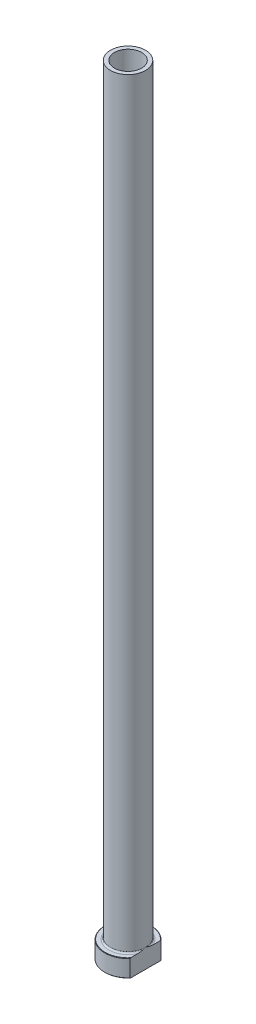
ISO-10303-21;
HEADER;
FILE_DESCRIPTION(('STEP AP214'),'2;1');
FILE_NAME('part.step','',(''),(''),'','','');
FILE_SCHEMA(('AUTOMOTIVE_DESIGN { 1 0 10303 214 1 1 1 1 }'));
ENDSEC;
DATA;
#1=APPLICATION_CONTEXT('core data for automotive mechanical design processes');
#2=APPLICATION_PROTOCOL_DEFINITION('international standard','automotive_design',2000,#1);
#3=PRODUCT_CONTEXT('',#1,'mechanical');
#4=PRODUCT('Part','Part','',(#3));
#5=PRODUCT_RELATED_PRODUCT_CATEGORY('part','',(#4));
#6=PRODUCT_DEFINITION_FORMATION('','',#4);
#7=PRODUCT_DEFINITION_CONTEXT('part definition',#1,'design');
#8=PRODUCT_DEFINITION('design','',#6,#7);
#9=PRODUCT_DEFINITION_SHAPE('','',#8);
#10=(LENGTH_UNIT() NAMED_UNIT(*) SI_UNIT(.MILLI.,.METRE.));
#11=(NAMED_UNIT(*) PLANE_ANGLE_UNIT() SI_UNIT($,.RADIAN.));
#12=(NAMED_UNIT(*) SI_UNIT($,.STERADIAN.) SOLID_ANGLE_UNIT());
#13=UNCERTAINTY_MEASURE_WITH_UNIT(LENGTH_MEASURE(1.E-05),#10,'distance_accuracy_value','');
#14=(GEOMETRIC_REPRESENTATION_CONTEXT(3) GLOBAL_UNCERTAINTY_ASSIGNED_CONTEXT((#13)) GLOBAL_UNIT_ASSIGNED_CONTEXT((#10,
#11,#12)) REPRESENTATION_CONTEXT('',''));
#15=CARTESIAN_POINT('',(0.,0.,0.));
#16=DIRECTION('',(0.,0.,1.));
#17=DIRECTION('',(1.,0.,0.));
#18=AXIS2_PLACEMENT_3D('',#15,#16,#17);
#19=CARTESIAN_POINT('',(0.,92.1876809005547,0.));
#20=DIRECTION('',(0.,1.,0.));
#21=DIRECTION('',(0.,0.,1.));
#22=AXIS2_PLACEMENT_3D('',#19,#20,#21);
#23=CYLINDRICAL_SURFACE('',#22,7.00000000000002);
#24=CARTESIAN_POINT('',(0.,400.,0.));
#25=DIRECTION('',(0.,1.,0.));
#26=DIRECTION('',(0.,0.,1.));
#27=AXIS2_PLACEMENT_3D('',#24,#25,#26);
#28=CIRCLE('',#27,7.00000000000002);
#29=CARTESIAN_POINT('',(0.,400.,7.00000000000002));
#30=VERTEX_POINT('',#29);
#31=EDGE_CURVE('E167',#30,#30,#28,.T.);
#32=ORIENTED_EDGE('',*,*,#31,.T.);
#33=EDGE_LOOP('',(#32));
#34=FACE_BOUND('',#33,.T.);
#35=CARTESIAN_POINT('',(0.,345.,0.));
#36=DIRECTION('',(0.,1.,0.));
#37=DIRECTION('',(0.,0.,1.));
#38=AXIS2_PLACEMENT_3D('',#35,#36,#37);
#39=CIRCLE('',#38,7.00000000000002);
#40=CARTESIAN_POINT('',(0.,345.,7.00000000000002));
#41=VERTEX_POINT('',#40);
#42=EDGE_CURVE('E170',#41,#41,#39,.T.);
#43=ORIENTED_EDGE('',*,*,#42,.F.);
#44=EDGE_LOOP('',(#43));
#45=FACE_BOUND('',#44,.T.);
#46=ADVANCED_FACE('F32',(#34,#45),#23,.F.);
#47=CARTESIAN_POINT('',(-7.00000000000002,400.,0.));
#48=DIRECTION('',(0.,1.,0.));
#49=DIRECTION('',(0.,0.,1.));
#50=AXIS2_PLACEMENT_3D('',#47,#48,#49);
#51=PLANE('',#50);
#52=CARTESIAN_POINT('',(0.,400.,0.));
#53=DIRECTION('',(0.,1.,0.));
#54=DIRECTION('',(0.,0.,1.));
#55=AXIS2_PLACEMENT_3D('',#52,#53,#54);
#56=CIRCLE('',#55,9.00000000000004);
#57=CARTESIAN_POINT('',(0.,400.,9.00000000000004));
#58=VERTEX_POINT('',#57);
#59=EDGE_CURVE('E174',#58,#58,#56,.T.);
#60=ORIENTED_EDGE('',*,*,#59,.T.);
#61=EDGE_LOOP('',(#60));
#62=FACE_BOUND('',#61,.T.);
#63=ORIENTED_EDGE('',*,*,#31,.F.);
#64=EDGE_LOOP('',(#63));
#65=FACE_BOUND('',#64,.T.);
#66=ADVANCED_FACE('F157',(#62,#65),#51,.T.);
#67=CARTESIAN_POINT('',(0.,92.1876809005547,0.));
#68=DIRECTION('',(0.,1.,0.));
#69=DIRECTION('',(0.,0.,1.));
#70=AXIS2_PLACEMENT_3D('',#67,#68,#69);
#71=CYLINDRICAL_SURFACE('',#70,9.00000000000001);
#72=CARTESIAN_POINT('',(0.,9.8,0.));
#73=DIRECTION('',(0.,1.,0.));
#74=DIRECTION('',(0.,0.,1.));
#75=AXIS2_PLACEMENT_3D('',#72,#73,#74);
#76=CIRCLE('',#75,9.00000000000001);
#77=CARTESIAN_POINT('',(9.00000000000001,9.8,0.));
#78=VERTEX_POINT('',#77);
#79=EDGE_CURVE('E180',#78,#78,#76,.T.);
#80=ORIENTED_EDGE('',*,*,#79,.T.);
#81=EDGE_LOOP('',(#80));
#82=FACE_BOUND('',#81,.T.);
#83=ORIENTED_EDGE('',*,*,#59,.F.);
#84=EDGE_LOOP('',(#83));
#85=FACE_BOUND('',#84,.T.);
#86=ADVANCED_FACE('F162',(#82,#85),#71,.T.);
#87=CARTESIAN_POINT('',(-8.99999999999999,9.,0.));
#88=DIRECTION('',(0.,1.,0.));
#89=DIRECTION('',(0.,0.,1.));
#90=AXIS2_PLACEMENT_3D('',#87,#88,#89);
#91=PLANE('',#90);
#92=DIRECTION('',(0.,0.,1.));
#93=VECTOR('',#92,1.);
#94=CARTESIAN_POINT('',(9.,9.,0.));
#95=LINE('',#94,#93);
#96=CARTESIAN_POINT('',(9.,9.,-7.63151361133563));
#97=VERTEX_POINT('',#96);
#98=CARTESIAN_POINT('',(9.,9.,-3.8781438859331));
#99=VERTEX_POINT('',#98);
#100=EDGE_CURVE('E54',#97,#99,#95,.T.);
#101=ORIENTED_EDGE('',*,*,#100,.F.);
#102=CARTESIAN_POINT('',(0.,9.,0.));
#103=DIRECTION('',(0.,1.,0.));
#104=DIRECTION('',(0.,0.,1.));
#105=AXIS2_PLACEMENT_3D('',#102,#103,#104);
#106=CIRCLE('',#105,11.8);
#107=CARTESIAN_POINT('',(8.99999999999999,9.,7.63151361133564));
#108=VERTEX_POINT('',#107);
#109=EDGE_CURVE('E186',#97,#108,#106,.T.);
#110=ORIENTED_EDGE('',*,*,#109,.T.);
#111=CARTESIAN_POINT('',(9.,9.,3.8781438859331));
#112=VERTEX_POINT('',#111);
#113=EDGE_CURVE('E134',#112,#108,#95,.T.);
#114=ORIENTED_EDGE('',*,*,#113,.F.);
#115=CARTESIAN_POINT('',(0.,9.,0.));
#116=DIRECTION('',(0.,1.,0.));
#117=DIRECTION('',(0.,0.,1.));
#118=AXIS2_PLACEMENT_3D('',#115,#116,#117);
#119=CIRCLE('',#118,9.80000000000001);
#120=EDGE_CURVE('E183',#112,#99,#119,.F.);
#121=ORIENTED_EDGE('',*,*,#120,.T.);
#122=EDGE_LOOP('',(#101,#110,#114,#121));
#123=FACE_BOUND('',#122,.T.);
#124=ADVANCED_FACE('F197',(#123),#91,.T.);
#125=CARTESIAN_POINT('',(0.,92.1876809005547,0.));
#126=DIRECTION('',(0.,1.,0.));
#127=DIRECTION('',(0.,0.,1.));
#128=AXIS2_PLACEMENT_3D('',#125,#126,#127);
#129=CYLINDRICAL_SURFACE('',#128,12.);
#130=DIRECTION('',(0.,-1.,0.));
#131=VECTOR('',#130,1.);
#132=CARTESIAN_POINT('',(8.99999999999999,400.,7.93725393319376));
#133=LINE('',#132,#131);
#134=CARTESIAN_POINT('',(8.99999999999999,8.80000000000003,7.93725393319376));
#135=VERTEX_POINT('',#134);
#136=CARTESIAN_POINT('',(8.99999999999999,0.199999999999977,7.93725393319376));
#137=VERTEX_POINT('',#136);
#138=EDGE_CURVE('E82',#135,#137,#133,.T.);
#139=ORIENTED_EDGE('',*,*,#138,.F.);
#140=CARTESIAN_POINT('',(0.,8.80000000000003,0.));
#141=DIRECTION('',(0.,1.,0.));
#142=DIRECTION('',(0.,0.,1.));
#143=AXIS2_PLACEMENT_3D('',#140,#141,#142);
#144=CIRCLE('',#143,12.);
#145=CARTESIAN_POINT('',(9.,8.80000000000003,-7.93725393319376));
#146=VERTEX_POINT('',#145);
#147=EDGE_CURVE('E95',#135,#146,#144,.F.);
#148=ORIENTED_EDGE('',*,*,#147,.T.);
#149=DIRECTION('',(0.,-1.,0.));
#150=VECTOR('',#149,1.);
#151=CARTESIAN_POINT('',(9.,400.,-7.93725393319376));
#152=LINE('',#151,#150);
#153=CARTESIAN_POINT('',(9.,0.199999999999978,-7.93725393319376));
#154=VERTEX_POINT('',#153);
#155=EDGE_CURVE('E192',#146,#154,#152,.T.);
#156=ORIENTED_EDGE('',*,*,#155,.T.);
#157=CARTESIAN_POINT('',(0.,0.199999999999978,0.));
#158=DIRECTION('',(0.,-1.,0.));
#159=DIRECTION('',(0.,0.,-1.));
#160=AXIS2_PLACEMENT_3D('',#157,#158,#159);
#161=CIRCLE('',#160,12.);
#162=EDGE_CURVE('E98',#154,#137,#161,.F.);
#163=ORIENTED_EDGE('',*,*,#162,.T.);
#164=EDGE_LOOP('',(#139,#148,#156,#163));
#165=FACE_BOUND('',#164,.T.);
#166=ADVANCED_FACE('F190',(#165),#129,.T.);
#167=CARTESIAN_POINT('',(-12.,0.,0.));
#168=DIRECTION('',(0.,-1.,0.));
#169=DIRECTION('',(0.,0.,-1.));
#170=AXIS2_PLACEMENT_3D('',#167,#168,#169);
#171=PLANE('',#170);
#172=CARTESIAN_POINT('',(0.,0.,0.));
#173=DIRECTION('',(0.,-1.,0.));
#174=DIRECTION('',(0.,0.,-1.));
#175=AXIS2_PLACEMENT_3D('',#172,#173,#174);
#176=CIRCLE('',#175,7.74999999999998);
#177=CARTESIAN_POINT('',(0.,0.,-7.74999999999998));
#178=VERTEX_POINT('',#177);
#179=EDGE_CURVE('E40',#178,#178,#176,.F.);
#180=ORIENTED_EDGE('',*,*,#179,.T.);
#181=EDGE_LOOP('',(#180));
#182=FACE_BOUND('',#181,.T.);
#183=DIRECTION('',(0.,0.,-1.));
#184=VECTOR('',#183,1.);
#185=CARTESIAN_POINT('',(8.99999999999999,0.,7.93725393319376));
#186=LINE('',#185,#184);
#187=CARTESIAN_POINT('',(8.99999999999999,0.,7.63151361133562));
#188=VERTEX_POINT('',#187);
#189=CARTESIAN_POINT('',(9.,0.,-7.63151361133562));
#190=VERTEX_POINT('',#189);
#191=EDGE_CURVE('E47',#188,#190,#186,.T.);
#192=ORIENTED_EDGE('',*,*,#191,.F.);
#193=CARTESIAN_POINT('',(0.,0.,0.));
#194=DIRECTION('',(0.,-1.,0.));
#195=DIRECTION('',(0.,0.,-1.));
#196=AXIS2_PLACEMENT_3D('',#193,#194,#195);
#197=CIRCLE('',#196,11.8);
#198=EDGE_CURVE('E92',#188,#190,#197,.T.);
#199=ORIENTED_EDGE('',*,*,#198,.T.);
#200=EDGE_LOOP('',(#192,#199));
#201=FACE_BOUND('',#200,.T.);
#202=ADVANCED_FACE('F91',(#182,#201),#171,.T.);
#203=CARTESIAN_POINT('',(0.,92.1876809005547,0.));
#204=DIRECTION('',(0.,1.,0.));
#205=DIRECTION('',(0.,0.,1.));
#206=AXIS2_PLACEMENT_3D('',#203,#204,#205);
#207=CYLINDRICAL_SURFACE('',#206,7.25000000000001);
#208=CARTESIAN_POINT('',(0.,0.5,0.));
#209=DIRECTION('',(0.,-1.,0.));
#210=DIRECTION('',(0.,0.,-1.));
#211=AXIS2_PLACEMENT_3D('',#208,#209,#210);
#212=CIRCLE('',#211,7.25000000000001);
#213=CARTESIAN_POINT('',(0.,0.5,-7.25000000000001));
#214=VERTEX_POINT('',#213);
#215=EDGE_CURVE('E11',#214,#214,#212,.T.);
#216=ORIENTED_EDGE('',*,*,#215,.T.);
#217=EDGE_LOOP('',(#216));
#218=FACE_BOUND('',#217,.T.);
#219=CARTESIAN_POINT('',(0.,333.,0.));
#220=DIRECTION('',(0.,1.,0.));
#221=DIRECTION('',(0.,0.,1.));
#222=AXIS2_PLACEMENT_3D('',#219,#220,#221);
#223=CIRCLE('',#222,7.25000000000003);
#224=CARTESIAN_POINT('',(0.,333.,7.25000000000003));
#225=VERTEX_POINT('',#224);
#226=EDGE_CURVE('E172',#225,#225,#223,.T.);
#227=ORIENTED_EDGE('',*,*,#226,.T.);
#228=EDGE_LOOP('',(#227));
#229=FACE_BOUND('',#228,.T.);
#230=ADVANCED_FACE('F215',(#218,#229),#207,.F.);
#231=CARTESIAN_POINT('',(0.,333.,0.));
#232=DIRECTION('',(0.,-1.,0.));
#233=DIRECTION('',(0.,0.,-1.));
#234=AXIS2_PLACEMENT_3D('',#231,#232,#233);
#235=CONICAL_SURFACE('',#234,7.25000000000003,0.0208303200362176);
#236=ORIENTED_EDGE('',*,*,#42,.T.);
#237=EDGE_LOOP('',(#236));
#238=FACE_BOUND('',#237,.T.);
#239=ORIENTED_EDGE('',*,*,#226,.F.);
#240=EDGE_LOOP('',(#239));
#241=FACE_BOUND('',#240,.T.);
#242=ADVANCED_FACE('F111',(#238,#241),#235,.F.);
#243=CARTESIAN_POINT('',(0.,9.8,0.));
#244=DIRECTION('',(0.,1.,0.));
#245=DIRECTION('',(0.,0.,1.));
#246=AXIS2_PLACEMENT_3D('',#243,#244,#245);
#247=TOROIDAL_SURFACE('',#246,9.80000000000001,0.8);
#248=ORIENTED_EDGE('',*,*,#120,.F.);
#249=CARTESIAN_POINT('',(9.00000000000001,9.8,0.));
#250=CARTESIAN_POINT('',(9.00000000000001,9.8000010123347,-6.46463501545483E-11));
#251=CARTESIAN_POINT('',(9.00000000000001,9.80000202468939,3.17332804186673E-07));
#252=CARTESIAN_POINT('',(9.00000000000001,9.80000393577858,1.2415479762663E-06));
#253=CARTESIAN_POINT('',(9.00000000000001,9.80000482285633,1.86583118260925E-06));
#254=CARTESIAN_POINT('',(9.00000000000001,9.80000663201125,3.35641421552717E-06));
#255=CARTESIAN_POINT('',(9.00000000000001,9.80000753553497,4.24567513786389E-06));
#256=CARTESIAN_POINT('',(9.00000000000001,9.80000918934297,6.11612340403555E-06));
#257=CARTESIAN_POINT('',(9.00000000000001,9.80000994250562,7.09492169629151E-06));
#258=CARTESIAN_POINT('',(9.00000000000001,9.80001263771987,1.07802727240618E-05));
#259=CARTESIAN_POINT('',(9.00000000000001,9.80001442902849,1.3600862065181E-05));
#260=CARTESIAN_POINT('',(9.00000000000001,9.80001746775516,1.92722568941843E-05));
#261=CARTESIAN_POINT('',(9.00000000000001,9.80001874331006,2.21087252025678E-05));
#262=CARTESIAN_POINT('',(9.00000000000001,9.8000239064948,3.37975092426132E-05));
#263=CARTESIAN_POINT('',(9.,9.80002763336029,4.27293238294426E-05));
#264=CARTESIAN_POINT('',(9.,9.80003330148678,5.98324887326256E-05));
#265=CARTESIAN_POINT('',(9.,9.80003541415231,6.79473032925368E-05));
#266=CARTESIAN_POINT('',(9.,9.80005049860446,0.000127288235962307));
#267=CARTESIAN_POINT('',(9.,9.80006163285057,0.000178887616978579));
#268=CARTESIAN_POINT('',(8.99999999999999,9.80011034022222,0.000381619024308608));
#269=CARTESIAN_POINT('',(8.99999999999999,9.80015710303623,0.000530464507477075));
#270=CARTESIAN_POINT('',(9.00000000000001,9.80033804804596,0.00111728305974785));
#271=CARTESIAN_POINT('',(9.,9.80046603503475,0.00155660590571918));
#272=CARTESIAN_POINT('',(8.99999999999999,9.80097635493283,0.00329406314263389));
#273=CARTESIAN_POINT('',(8.99999999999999,9.80136631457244,0.00459050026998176));
#274=CARTESIAN_POINT('',(9.00000000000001,9.80298403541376,0.00998416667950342));
#275=CARTESIAN_POINT('',(9.,9.80420236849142,0.0140834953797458));
#276=CARTESIAN_POINT('',(8.99999999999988,9.82648661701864,0.0890427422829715));
#277=CARTESIAN_POINT('',(8.99999999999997,9.84764626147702,0.159882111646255));
#278=CARTESIAN_POINT('',(9.00000000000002,9.88895908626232,0.298764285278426));
#279=CARTESIAN_POINT('',(9.00000000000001,9.90911860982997,0.366805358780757));
#280=CARTESIAN_POINT('',(8.99999999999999,9.95179311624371,0.5115245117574));
#281=CARTESIAN_POINT('',(8.99999999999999,9.97428452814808,0.588209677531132));
#282=CARTESIAN_POINT('',(9.,10.0191408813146,0.742532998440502));
#283=CARTESIAN_POINT('',(9.,10.0415017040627,0.820172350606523));
#284=CARTESIAN_POINT('',(9.,10.079411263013,0.953448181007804));
#285=CARTESIAN_POINT('',(9.,10.0950851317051,1.009049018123));
#286=CARTESIAN_POINT('',(9.,10.1260784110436,1.1201953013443));
#287=CARTESIAN_POINT('',(9.,10.1413986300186,1.17574052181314));
#288=CARTESIAN_POINT('',(9.,10.1860703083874,1.33980716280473));
#289=CARTESIAN_POINT('',(9.,10.2149083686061,1.44846861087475));
#290=CARTESIAN_POINT('',(9.,10.2856369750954,1.72417832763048));
#291=CARTESIAN_POINT('',(9.,10.3263124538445,1.89154391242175));
#292=CARTESIAN_POINT('',(9.,10.4020454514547,2.22904779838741));
#293=CARTESIAN_POINT('',(9.,10.4370523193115,2.39919757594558));
#294=CARTESIAN_POINT('',(9.,10.5014391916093,2.75494052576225));
#295=CARTESIAN_POINT('',(9.,10.5301301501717,2.94066439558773));
#296=CARTESIAN_POINT('',(9.,10.5633122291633,3.2201620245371));
#297=CARTESIAN_POINT('',(9.,10.5727244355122,3.31335338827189));
#298=CARTESIAN_POINT('',(9.,10.5877042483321,3.50003892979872));
#299=CARTESIAN_POINT('',(9.,10.5932725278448,3.59353305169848));
#300=CARTESIAN_POINT('',(9.,10.5997812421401,3.77831079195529));
#301=CARTESIAN_POINT('',(9.,10.6008358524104,3.86959010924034));
#302=CARTESIAN_POINT('',(9.,10.5977997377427,4.05215299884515));
#303=CARTESIAN_POINT('',(8.99999999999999,10.5937049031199,4.14343651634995));
#304=CARTESIAN_POINT('',(8.99999999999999,10.579384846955,4.32415905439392));
#305=CARTESIAN_POINT('',(8.99999999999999,10.5692536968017,4.41360502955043));
#306=CARTESIAN_POINT('',(8.99999999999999,10.5415393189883,4.5912576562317));
#307=CARTESIAN_POINT('',(8.99999999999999,10.5239649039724,4.67946564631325));
#308=CARTESIAN_POINT('',(8.99999999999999,10.4790565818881,4.85471882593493));
#309=CARTESIAN_POINT('',(8.99999999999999,10.4516029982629,4.94173554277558));
#310=CARTESIAN_POINT('',(8.99999999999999,10.4007972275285,5.06830195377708));
#311=CARTESIAN_POINT('',(8.99999999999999,10.3822808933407,5.10979172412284));
#312=CARTESIAN_POINT('',(8.99999999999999,10.3414775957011,5.19085457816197));
#313=CARTESIAN_POINT('',(8.99999999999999,10.3191952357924,5.23042992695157));
#314=CARTESIAN_POINT('',(8.99999999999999,10.2750362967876,5.29920261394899));
#315=CARTESIAN_POINT('',(8.99999999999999,10.2539514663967,5.32890420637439));
#316=CARTESIAN_POINT('',(8.99999999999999,10.2085010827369,5.3857714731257));
#317=CARTESIAN_POINT('',(8.99999999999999,10.18413270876,5.4129349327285));
#318=CARTESIAN_POINT('',(8.99999999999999,10.1314615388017,5.46389233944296));
#319=CARTESIAN_POINT('',(8.99999999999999,10.1031152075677,5.4876421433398));
#320=CARTESIAN_POINT('',(8.99999999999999,10.0426124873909,5.52966859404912));
#321=CARTESIAN_POINT('',(8.99999999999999,10.0104678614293,5.54796155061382));
#322=CARTESIAN_POINT('',(8.99999999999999,9.95377518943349,5.57238639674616));
#323=CARTESIAN_POINT('',(8.99999999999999,9.93009823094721,5.58053697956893));
#324=CARTESIAN_POINT('',(8.99999999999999,9.88171464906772,5.59278453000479));
#325=CARTESIAN_POINT('',(8.99999999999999,9.8570089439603,5.5968850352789));
#326=CARTESIAN_POINT('',(8.99999999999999,9.80717489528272,5.60067699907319));
#327=CARTESIAN_POINT('',(8.99999999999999,9.7820454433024,5.60035415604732));
#328=CARTESIAN_POINT('',(8.99999999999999,9.73223420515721,5.5952956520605));
#329=CARTESIAN_POINT('',(8.99999999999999,9.70755259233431,5.59055831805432));
#330=CARTESIAN_POINT('',(8.99999999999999,9.66020362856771,5.57733425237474));
#331=CARTESIAN_POINT('',(8.99999999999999,9.63749568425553,5.56898983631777));
#332=CARTESIAN_POINT('',(8.99999999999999,9.59351516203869,5.54915687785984));
#333=CARTESIAN_POINT('',(8.99999999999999,9.57224307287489,5.53766727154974));
#334=CARTESIAN_POINT('',(8.99999999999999,9.51928150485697,5.50462580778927));
#335=CARTESIAN_POINT('',(8.99999999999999,9.48880776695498,5.48112661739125));
#336=CARTESIAN_POINT('',(8.99999999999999,9.4318905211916,5.42965338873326));
#337=CARTESIAN_POINT('',(8.99999999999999,9.40546009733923,5.40166539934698));
#338=CARTESIAN_POINT('',(8.99999999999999,9.34005551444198,5.32319042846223));
#339=CARTESIAN_POINT('',(8.99999999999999,9.30430472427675,5.2700386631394));
#340=CARTESIAN_POINT('',(8.99999999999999,9.24095813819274,5.15926391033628));
#341=CARTESIAN_POINT('',(8.99999999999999,9.21336826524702,5.10163771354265));
#342=CARTESIAN_POINT('',(8.99999999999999,9.16551403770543,4.98579619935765));
#343=CARTESIAN_POINT('',(8.99999999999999,9.14502939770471,4.92767012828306));
#344=CARTESIAN_POINT('',(8.99999999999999,9.10900516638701,4.80987690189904));
#345=CARTESIAN_POINT('',(8.99999999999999,9.0934705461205,4.75020826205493));
#346=CARTESIAN_POINT('',(8.99999999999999,9.06639912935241,4.62926355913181));
#347=CARTESIAN_POINT('',(8.99999999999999,9.05491059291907,4.56797688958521));
#348=CARTESIAN_POINT('',(8.99999999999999,9.03554988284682,4.44488746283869));
#349=CARTESIAN_POINT('',(8.99999999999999,9.02767548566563,4.38308504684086));
#350=CARTESIAN_POINT('',(8.99999999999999,9.01237706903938,4.23320098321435));
#351=CARTESIAN_POINT('',(8.99999999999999,9.00652460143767,4.14495990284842));
#352=CARTESIAN_POINT('',(8.99999999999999,8.99996624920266,3.96827125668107));
#353=CARTESIAN_POINT('',(9.,8.99926276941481,3.8798236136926));
#354=CARTESIAN_POINT('',(9.,9.00218728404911,3.70272096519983));
#355=CARTESIAN_POINT('',(9.,9.00582939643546,3.6140662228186));
#356=CARTESIAN_POINT('',(9.,9.01681466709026,3.4369808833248));
#357=CARTESIAN_POINT('',(9.,9.02415848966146,3.34855032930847));
#358=CARTESIAN_POINT('',(9.,9.04989749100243,3.09391807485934));
#359=CARTESIAN_POINT('',(9.,9.07232194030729,2.92812217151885));
#360=CARTESIAN_POINT('',(9.,9.12539895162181,2.59921508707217));
#361=CARTESIAN_POINT('',(9.,9.15598725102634,2.43609307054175));
#362=CARTESIAN_POINT('',(9.,9.22330285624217,2.11182788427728));
#363=CARTESIAN_POINT('',(9.,9.26000471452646,1.95067936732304));
#364=CARTESIAN_POINT('',(9.,9.31897632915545,1.70786584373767));
#365=CARTESIAN_POINT('',(9.,9.33955107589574,1.62578051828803));
#366=CARTESIAN_POINT('',(9.,9.38177259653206,1.46165638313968));
#367=CARTESIAN_POINT('',(9.,9.40342203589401,1.37961825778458));
#368=CARTESIAN_POINT('',(9.,9.45602430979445,1.18435079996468));
#369=CARTESIAN_POINT('',(9.,9.48736095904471,1.07122519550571));
#370=CARTESIAN_POINT('',(9.,9.5508395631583,0.846545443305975));
#371=CARTESIAN_POINT('',(8.99999999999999,9.58296886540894,0.734987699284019));
#372=CARTESIAN_POINT('',(9.,9.64431039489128,0.524609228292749));
#373=CARTESIAN_POINT('',(9.,9.67344475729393,0.425765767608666));
#374=CARTESIAN_POINT('',(8.99999999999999,9.71808680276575,0.275077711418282));
#375=CARTESIAN_POINT('',(8.99999999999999,9.73349584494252,0.223203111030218));
#376=CARTESIAN_POINT('',(9.00000000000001,9.76415269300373,0.120285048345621));
#377=CARTESIAN_POINT('',(9.00000000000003,9.77939925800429,0.069241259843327));
#378=CARTESIAN_POINT('',(8.99999999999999,9.79579831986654,0.0140813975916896));
#379=CARTESIAN_POINT('',(8.99999999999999,9.79701722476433,0.00997994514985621));
#380=CARTESIAN_POINT('',(9.,9.7986350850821,0.00458578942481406));
#381=CARTESIAN_POINT('',(9.,9.79902455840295,0.00329097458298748));
#382=CARTESIAN_POINT('',(8.99999999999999,9.79953428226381,0.00155554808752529));
#383=CARTESIAN_POINT('',(8.99999999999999,9.79966215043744,0.00111663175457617));
#384=CARTESIAN_POINT('',(9.,9.7998429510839,0.000530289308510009));
#385=CARTESIAN_POINT('',(9.,9.7998896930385,0.000381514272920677));
#386=CARTESIAN_POINT('',(8.99999999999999,9.79993838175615,0.000178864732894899));
#387=CARTESIAN_POINT('',(8.99999999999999,9.79994951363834,0.000127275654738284));
#388=CARTESIAN_POINT('',(9.,9.79996459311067,6.79451409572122E-05));
#389=CARTESIAN_POINT('',(9.00000000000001,9.799966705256,5.98309375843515E-05));
#390=CARTESIAN_POINT('',(9.00000000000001,9.79997237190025,4.27289898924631E-05));
#391=CARTESIAN_POINT('',(9.00000000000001,9.79997609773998,3.37977495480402E-05));
#392=CARTESIAN_POINT('',(9.00000000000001,9.79998125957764,2.21095479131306E-05));
#393=CARTESIAN_POINT('',(9.00000000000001,9.79998253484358,1.92731252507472E-05));
#394=CARTESIAN_POINT('',(9.00000000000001,9.79998557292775,1.36017707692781E-05));
#395=CARTESIAN_POINT('',(9.00000000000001,9.79998736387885,1.07811711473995E-05));
#396=CARTESIAN_POINT('',(9.00000000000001,9.79999005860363,7.09574593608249E-06));
#397=CARTESIAN_POINT('',(9.00000000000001,9.79999081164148,6.11691275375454E-06));
#398=CARTESIAN_POINT('',(9.00000000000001,9.79999246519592,4.24637220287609E-06));
#399=CARTESIAN_POINT('',(9.00000000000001,9.79999336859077,3.35705330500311E-06));
#400=CARTESIAN_POINT('',(9.00000000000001,9.79999517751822,1.86633240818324E-06));
#401=CARTESIAN_POINT('',(9.00000000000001,9.79999606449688,1.24197376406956E-06));
#402=CARTESIAN_POINT('',(9.00000000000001,9.79999797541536,3.1757107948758E-07));
#403=CARTESIAN_POINT('',(9.00000000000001,9.79999898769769,6.46482157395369E-11));
#404=CARTESIAN_POINT('',(9.00000000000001,9.8,0.));
#405=B_SPLINE_CURVE_WITH_KNOTS('',3,(#249,#250,#251,#252,#253,#254,#255,#256,#257,#258,#259,
#260,#261,#262,#263,#264,#265,#266,#267,#268,#269,#270,#271,#272,#273,#274,#275,#276,#277,#278,
#279,#280,#281,#282,#283,#284,#285,#286,#287,#288,#289,#290,#291,#292,#293,#294,#295,#296,#297,
#298,#299,#300,#301,#302,#303,#304,#305,#306,#307,#308,#309,#310,#311,#312,#313,#314,#315,#316,
#317,#318,#319,#320,#321,#322,#323,#324,#325,#326,#327,#328,#329,#330,#331,#332,#333,#334,#335,
#336,#337,#338,#339,#340,#341,#342,#343,#344,#345,#346,#347,#348,#349,#350,#351,#352,#353,#354,
#355,#356,#357,#358,#359,#360,#361,#362,#363,#364,#365,#366,#367,#368,#369,#370,#371,#372,#373,
#374,#375,#376,#377,#378,#379,#380,#381,#382,#383,#384,#385,#386,#387,#388,#389,#390,#391,#392,
#393,#394,#395,#396,#397,#398,#399,#400,#401,#402,#403,#404),.UNSPECIFIED.,.T.,.F.,(4,2,2,2,2,2,
2,2,2,2,2,2,2,2,2,2,2,2,2,2,2,2,2,2,2,2,2,2,2,2,2,2,2,2,2,2,2,2,2,2,2,2,2,2,2,2,2,2,2,2,2,2,2,2,
2,2,2,2,2,2,2,2,2,2,2,2,2,2,2,2,2,2,2,2,2,2,2,4),(0.,3.0477132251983E-06,6.29345622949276E-06,
1.00769788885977E-05,1.37791101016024E-05,2.37619242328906E-05,3.30844746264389E-05,
6.20551883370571E-05,8.71784949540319E-05,0.000245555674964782,0.000713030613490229,
0.00208637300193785,0.00614710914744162,0.0189775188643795,0.240764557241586,0.453660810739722,
0.693405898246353,0.935790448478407,1.10909318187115,1.28194996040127,1.61921055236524,
2.1358388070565,2.65685508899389,3.22023907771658,3.50117319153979,3.78205810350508,
4.05579427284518,4.32974904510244,4.59954218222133,4.86901677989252,5.1418722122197,
5.27802968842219,5.41402191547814,5.52311134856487,5.63229509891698,5.74278355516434,
5.85293838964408,5.92775570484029,6.00250761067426,6.07750126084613,6.15252334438,
6.22482267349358,6.29714648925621,6.41192958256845,6.52707659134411,6.71816463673,
6.90939103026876,7.09400621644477,7.27880622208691,7.46574121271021,7.65256103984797,
7.91766914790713,8.18290106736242,8.44899702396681,8.71514075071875,9.21672782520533,
9.71447745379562,10.210204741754,10.464073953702,10.7186077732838,11.0707555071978,
11.4190290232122,11.7281703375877,11.8905163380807,12.050326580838,12.0631635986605,
12.0672192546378,12.0685913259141,12.0690585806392,12.0692169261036,12.0692420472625,
12.0692710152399,12.0692803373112,12.0692903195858,12.069294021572,12.0692978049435,
12.0693010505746,12.0693040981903),.UNSPECIFIED.);
#406=EDGE_CURVE('E126',#112,#78,#405,.T.);
#407=ORIENTED_EDGE('',*,*,#406,.T.);
#408=ORIENTED_EDGE('',*,*,#79,.F.);
#409=CARTESIAN_POINT('',(9.00000000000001,9.8,0.));
#410=CARTESIAN_POINT('',(9.00000000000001,9.7999989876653,6.46502918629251E-11));
#411=CARTESIAN_POINT('',(9.00000000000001,9.79999797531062,-3.17332800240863E-07));
#412=CARTESIAN_POINT('',(9.00000000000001,9.79999606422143,-1.24154797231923E-06));
#413=CARTESIAN_POINT('',(9.00000000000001,9.79999517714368,-1.86583117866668E-06));
#414=CARTESIAN_POINT('',(9.00000000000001,9.79999336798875,-3.35641421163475E-06));
#415=CARTESIAN_POINT('',(9.00000000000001,9.79999246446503,-4.24567513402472E-06));
#416=CARTESIAN_POINT('',(9.00000000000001,9.79999081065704,-6.11612340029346E-06));
#417=CARTESIAN_POINT('',(9.00000000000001,9.79999005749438,-7.09492169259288E-06));
#418=CARTESIAN_POINT('',(9.00000000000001,9.79998736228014,-1.07802727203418E-05));
#419=CARTESIAN_POINT('',(9.00000000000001,9.79998557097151,-1.36008620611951E-05));
#420=CARTESIAN_POINT('',(9.00000000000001,9.79998253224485,-1.92722568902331E-05));
#421=CARTESIAN_POINT('',(9.00000000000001,9.79998125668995,-2.21087251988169E-05));
#422=CARTESIAN_POINT('',(9.00000000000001,9.79997609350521,-3.37975092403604E-05));
#423=CARTESIAN_POINT('',(9.00000000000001,9.79997236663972,-4.27293238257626E-05));
#424=CARTESIAN_POINT('',(9.00000000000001,9.79996669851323,-5.9832488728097E-05));
#425=CARTESIAN_POINT('',(9.,9.7999645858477,-6.79473032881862E-05));
#426=CARTESIAN_POINT('',(8.99999999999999,9.79994950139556,-0.000127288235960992));
#427=CARTESIAN_POINT('',(8.99999999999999,9.79993836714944,-0.000178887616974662));
#428=CARTESIAN_POINT('',(9.,9.79988965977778,-0.000381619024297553));
#429=CARTESIAN_POINT('',(9.,9.79984289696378,-0.000530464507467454));
#430=CARTESIAN_POINT('',(8.99999999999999,9.79966195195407,-0.00111728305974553));
#431=CARTESIAN_POINT('',(8.99999999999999,9.79953396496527,-0.0015566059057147));
#432=CARTESIAN_POINT('',(9.,9.79902364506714,-0.00329406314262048));
#433=CARTESIAN_POINT('',(9.,9.79863368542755,-0.00459050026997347));
#434=CARTESIAN_POINT('',(8.99999999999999,9.79701596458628,-0.00998416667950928));
#435=CARTESIAN_POINT('',(8.99999999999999,9.7957976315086,-0.0140834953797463));
#436=CARTESIAN_POINT('',(9.00000000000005,9.7735133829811,-0.0890427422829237));
#437=CARTESIAN_POINT('',(9.00000000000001,9.7523537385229,-0.159882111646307));
#438=CARTESIAN_POINT('',(8.99999999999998,9.71104091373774,-0.298764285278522));
#439=CARTESIAN_POINT('',(8.99999999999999,9.69088139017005,-0.366805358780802));
#440=CARTESIAN_POINT('',(9.,9.64820688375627,-0.511524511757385));
#441=CARTESIAN_POINT('',(9.,9.62571547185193,-0.588209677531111));
#442=CARTESIAN_POINT('',(8.99999999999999,9.58085911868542,-0.742532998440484));
#443=CARTESIAN_POINT('',(9.,9.55849829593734,-0.820172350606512));
#444=CARTESIAN_POINT('',(9.,9.52058873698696,-0.953448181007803));
#445=CARTESIAN_POINT('',(9.,9.50491486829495,-1.00904901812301));
#446=CARTESIAN_POINT('',(9.,9.47392158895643,-1.1201953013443));
#447=CARTESIAN_POINT('',(9.,9.45860136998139,-1.17574052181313));
#448=CARTESIAN_POINT('',(9.,9.41392969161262,-1.33980716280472));
#449=CARTESIAN_POINT('',(9.,9.38509163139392,-1.44846861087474));
#450=CARTESIAN_POINT('',(9.,9.31436302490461,-1.72417832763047));
#451=CARTESIAN_POINT('',(9.,9.27368754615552,-1.89154391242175));
#452=CARTESIAN_POINT('',(9.,9.19795454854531,-2.22904779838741));
#453=CARTESIAN_POINT('',(9.,9.16294768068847,-2.39919757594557));
#454=CARTESIAN_POINT('',(9.,9.09856080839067,-2.75494052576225));
#455=CARTESIAN_POINT('',(9.,9.06986984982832,-2.94066439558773));
#456=CARTESIAN_POINT('',(9.,9.03668777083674,-3.22016202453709));
#457=CARTESIAN_POINT('',(9.,9.0272755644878,-3.31335338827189));
#458=CARTESIAN_POINT('',(9.,9.01229575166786,-3.50003892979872));
#459=CARTESIAN_POINT('',(9.,9.00672747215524,-3.59353305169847));
#460=CARTESIAN_POINT('',(9.,9.00021875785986,-3.77831079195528));
#461=CARTESIAN_POINT('',(9.,8.99916414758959,-3.86959010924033));
#462=CARTESIAN_POINT('',(9.,9.00220026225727,-4.05215299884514));
#463=CARTESIAN_POINT('',(9.,9.0062950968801,-4.14343651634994));
#464=CARTESIAN_POINT('',(9.,9.02061515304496,-4.32415905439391));
#465=CARTESIAN_POINT('',(9.,9.03074630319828,-4.41360502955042));
#466=CARTESIAN_POINT('',(9.,9.0584606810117,-4.59125765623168));
#467=CARTESIAN_POINT('',(9.,9.07603509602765,-4.67946564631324));
#468=CARTESIAN_POINT('',(9.,9.12094341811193,-4.85471882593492));
#469=CARTESIAN_POINT('',(9.,9.14839700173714,-4.94173554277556));
#470=CARTESIAN_POINT('',(9.,9.19920277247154,-5.06830195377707));
#471=CARTESIAN_POINT('',(9.,9.21771910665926,-5.10979172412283));
#472=CARTESIAN_POINT('',(9.,9.25852240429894,-5.19085457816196));
#473=CARTESIAN_POINT('',(9.,9.28080476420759,-5.23042992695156));
#474=CARTESIAN_POINT('',(9.,9.32496370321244,-5.29920261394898));
#475=CARTESIAN_POINT('',(9.,9.34604853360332,-5.32890420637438));
#476=CARTESIAN_POINT('',(9.,9.39149891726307,-5.38577147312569));
#477=CARTESIAN_POINT('',(9.,9.41586729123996,-5.41293493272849));
#478=CARTESIAN_POINT('',(9.,9.46853846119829,-5.46389233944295));
#479=CARTESIAN_POINT('',(9.,9.49688479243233,-5.48764214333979));
#480=CARTESIAN_POINT('',(9.,9.55738751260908,-5.52966859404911));
#481=CARTESIAN_POINT('',(9.,9.58953213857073,-5.54796155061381));
#482=CARTESIAN_POINT('',(9.,9.64622481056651,-5.57238639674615));
#483=CARTESIAN_POINT('',(9.,9.66990176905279,-5.58053697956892));
#484=CARTESIAN_POINT('',(9.,9.71828535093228,-5.59278453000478));
#485=CARTESIAN_POINT('',(9.,9.7429910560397,-5.59688503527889));
#486=CARTESIAN_POINT('',(9.,9.79282510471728,-5.60067699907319));
#487=CARTESIAN_POINT('',(9.,9.81795455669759,-5.60035415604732));
#488=CARTESIAN_POINT('',(9.,9.86776579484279,-5.5952956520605));
#489=CARTESIAN_POINT('',(9.,9.89244740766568,-5.59055831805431));
#490=CARTESIAN_POINT('',(9.,9.93979637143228,-5.57733425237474));
#491=CARTESIAN_POINT('',(9.,9.96250431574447,-5.56898983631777));
#492=CARTESIAN_POINT('',(9.,10.0064848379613,-5.54915687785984));
#493=CARTESIAN_POINT('',(9.,10.0277569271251,-5.53766727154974));
#494=CARTESIAN_POINT('',(9.,10.080718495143,-5.50462580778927));
#495=CARTESIAN_POINT('',(9.,10.111192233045,-5.48112661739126));
#496=CARTESIAN_POINT('',(9.,10.1681094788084,-5.42965338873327));
#497=CARTESIAN_POINT('',(9.,10.1945399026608,-5.40166539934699));
#498=CARTESIAN_POINT('',(9.,10.259944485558,-5.32319042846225));
#499=CARTESIAN_POINT('',(9.,10.2956952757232,-5.27003866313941));
#500=CARTESIAN_POINT('',(9.,10.3590418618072,-5.1592639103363));
#501=CARTESIAN_POINT('',(9.,10.386631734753,-5.10163771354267));
#502=CARTESIAN_POINT('',(9.,10.4344859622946,-4.98579619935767));
#503=CARTESIAN_POINT('',(9.,10.4549706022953,-4.92767012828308));
#504=CARTESIAN_POINT('',(9.,10.490994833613,-4.80987690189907));
#505=CARTESIAN_POINT('',(9.,10.5065294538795,-4.75020826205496));
#506=CARTESIAN_POINT('',(9.,10.5336008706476,-4.62926355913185));
#507=CARTESIAN_POINT('',(9.,10.5450894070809,-4.56797688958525));
#508=CARTESIAN_POINT('',(9.,10.5644501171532,-4.44488746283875));
#509=CARTESIAN_POINT('',(9.,10.5723245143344,-4.38308504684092));
#510=CARTESIAN_POINT('',(9.,10.5876229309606,-4.23320098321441));
#511=CARTESIAN_POINT('',(9.,10.5934753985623,-4.14495990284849));
#512=CARTESIAN_POINT('',(9.,10.6000337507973,-3.96827125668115));
#513=CARTESIAN_POINT('',(9.,10.6007372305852,-3.87982361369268));
#514=CARTESIAN_POINT('',(9.,10.5978127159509,-3.70272096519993));
#515=CARTESIAN_POINT('',(9.,10.5941706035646,-3.61406622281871));
#516=CARTESIAN_POINT('',(9.,10.5831853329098,-3.43698088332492));
#517=CARTESIAN_POINT('',(9.,10.5758415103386,-3.3485503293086));
#518=CARTESIAN_POINT('',(9.,10.5501025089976,-3.09391807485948));
#519=CARTESIAN_POINT('',(9.,10.5276780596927,-2.92812217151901));
#520=CARTESIAN_POINT('',(9.,10.4746010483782,-2.59921508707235));
#521=CARTESIAN_POINT('',(9.,10.4440127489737,-2.43609307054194));
#522=CARTESIAN_POINT('',(9.,10.3766971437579,-2.11182788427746));
#523=CARTESIAN_POINT('',(9.,10.3399952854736,-1.95067936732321));
#524=CARTESIAN_POINT('',(9.,10.2810236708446,-1.70786584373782));
#525=CARTESIAN_POINT('',(9.,10.2604489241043,-1.62578051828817));
#526=CARTESIAN_POINT('',(9.,10.218227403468,-1.4616563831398));
#527=CARTESIAN_POINT('',(9.,10.196577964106,-1.3796182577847));
#528=CARTESIAN_POINT('',(9.,10.1439756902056,-1.18435079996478));
#529=CARTESIAN_POINT('',(9.,10.1126390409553,-1.0712251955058));
#530=CARTESIAN_POINT('',(9.,10.0491604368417,-0.846545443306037));
#531=CARTESIAN_POINT('',(8.99999999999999,10.0170311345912,-0.734987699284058));
#532=CARTESIAN_POINT('',(9.,9.95568960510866,-0.52460922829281));
#533=CARTESIAN_POINT('',(9.,9.9265552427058,-0.425765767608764));
#534=CARTESIAN_POINT('',(8.99999999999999,9.88191319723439,-0.275077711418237));
#535=CARTESIAN_POINT('',(8.99999999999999,9.86650415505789,-0.223203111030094));
#536=CARTESIAN_POINT('',(9.00000000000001,9.83584730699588,-0.120285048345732));
#537=CARTESIAN_POINT('',(9.00000000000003,9.82060074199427,-0.0692412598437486));
#538=CARTESIAN_POINT('',(8.99999999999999,9.80420168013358,-0.0140813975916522));
#539=CARTESIAN_POINT('',(8.99999999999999,9.80298277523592,-0.00997994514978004));
#540=CARTESIAN_POINT('',(9.,9.80136491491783,-0.00458578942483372));
#541=CARTESIAN_POINT('',(9.,9.80097544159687,-0.00329097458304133));
#542=CARTESIAN_POINT('',(8.99999999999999,9.80046571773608,-0.00155554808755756));
#543=CARTESIAN_POINT('',(8.99999999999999,9.8003378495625,-0.00111663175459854));
#544=CARTESIAN_POINT('',(9.,9.80015704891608,-0.000530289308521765));
#545=CARTESIAN_POINT('',(9.,9.80011030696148,-0.000381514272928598));
#546=CARTESIAN_POINT('',(8.99999999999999,9.80006161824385,-0.000178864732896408));
#547=CARTESIAN_POINT('',(8.99999999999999,9.80005048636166,-0.000127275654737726));
#548=CARTESIAN_POINT('',(9.,9.80003540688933,-6.79451409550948E-05));
#549=CARTESIAN_POINT('',(9.00000000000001,9.800033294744,-5.98309375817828E-05));
#550=CARTESIAN_POINT('',(9.00000000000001,9.80002762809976,-4.27289898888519E-05));
#551=CARTESIAN_POINT('',(9.00000000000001,9.80002390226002,-3.37977495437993E-05));
#552=CARTESIAN_POINT('',(9.00000000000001,9.80001874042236,-2.21095479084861E-05));
#553=CARTESIAN_POINT('',(9.00000000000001,9.80001746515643,-1.92731252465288E-05));
#554=CARTESIAN_POINT('',(9.00000000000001,9.80001442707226,-1.36017707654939E-05));
#555=CARTESIAN_POINT('',(9.00000000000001,9.80001263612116,-1.07811711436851E-05));
#556=CARTESIAN_POINT('',(9.00000000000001,9.80000994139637,-7.09574593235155E-06));
#557=CARTESIAN_POINT('',(9.00000000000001,9.80000918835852,-6.11691275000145E-06));
#558=CARTESIAN_POINT('',(9.00000000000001,9.80000753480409,-4.24637219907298E-06));
#559=CARTESIAN_POINT('',(9.00000000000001,9.80000663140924,-3.35705330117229E-06));
#560=CARTESIAN_POINT('',(9.00000000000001,9.80000482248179,-1.86633240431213E-06));
#561=CARTESIAN_POINT('',(9.00000000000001,9.80000393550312,-1.24197376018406E-06));
#562=CARTESIAN_POINT('',(9.00000000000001,9.80000202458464,-3.17571075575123E-07));
#563=CARTESIAN_POINT('',(9.00000000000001,9.80000101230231,-6.46442894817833E-11));
#564=CARTESIAN_POINT('',(9.00000000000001,9.8,0.));
#565=B_SPLINE_CURVE_WITH_KNOTS('',3,(#409,#410,#411,#412,#413,#414,#415,#416,#417,#418,#419,
#420,#421,#422,#423,#424,#425,#426,#427,#428,#429,#430,#431,#432,#433,#434,#435,#436,#437,#438,
#439,#440,#441,#442,#443,#444,#445,#446,#447,#448,#449,#450,#451,#452,#453,#454,#455,#456,#457,
#458,#459,#460,#461,#462,#463,#464,#465,#466,#467,#468,#469,#470,#471,#472,#473,#474,#475,#476,
#477,#478,#479,#480,#481,#482,#483,#484,#485,#486,#487,#488,#489,#490,#491,#492,#493,#494,#495,
#496,#497,#498,#499,#500,#501,#502,#503,#504,#505,#506,#507,#508,#509,#510,#511,#512,#513,#514,
#515,#516,#517,#518,#519,#520,#521,#522,#523,#524,#525,#526,#527,#528,#529,#530,#531,#532,#533,
#534,#535,#536,#537,#538,#539,#540,#541,#542,#543,#544,#545,#546,#547,#548,#549,#550,#551,#552,
#553,#554,#555,#556,#557,#558,#559,#560,#561,#562,#563,#564),.UNSPECIFIED.,.T.,.F.,(4,2,2,2,2,2,
2,2,2,2,2,2,2,2,2,2,2,2,2,2,2,2,2,2,2,2,2,2,2,2,2,2,2,2,2,2,2,2,2,2,2,2,2,2,2,2,2,2,2,2,2,2,2,2,
2,2,2,2,2,2,2,2,2,2,2,2,2,2,2,2,2,2,2,2,2,2,2,4),(0.,3.04771322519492E-06,6.29345622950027E-06,
1.00769788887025E-05,1.3779110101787E-05,2.37619242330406E-05,3.30844746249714E-05,
6.20551883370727E-05,8.71784949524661E-05,0.000245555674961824,0.00071303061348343,
0.00208637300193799,0.00614710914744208,0.0189775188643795,0.240764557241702,0.45366081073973,
0.693405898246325,0.935790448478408,1.10909318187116,1.28194996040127,1.61921055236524,
2.1358388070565,2.65685508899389,3.22023907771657,3.50117319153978,3.78205810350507,
4.05579427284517,4.32974904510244,4.59954218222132,4.86901677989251,5.14187221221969,
5.27802968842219,5.41402191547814,5.52311134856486,5.63229509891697,5.74278355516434,
5.85293838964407,5.92775570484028,6.00250761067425,6.07750126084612,6.15252334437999,
6.22482267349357,6.2971464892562,6.41192958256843,6.52707659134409,6.71816463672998,
6.90939103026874,7.09400621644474,7.27880622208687,7.46574121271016,7.65256103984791,
7.91766914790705,8.18290106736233,8.4489970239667,8.71514075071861,9.21672782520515,
9.71447745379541,10.2102047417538,10.4640739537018,10.7186077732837,11.0707555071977,
11.4190290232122,11.7281703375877,11.8905163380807,12.050326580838,12.0631635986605,
12.0672192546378,12.0685913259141,12.0690585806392,12.0692169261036,12.0692420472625,
12.0692710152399,12.0692803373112,12.0692903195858,12.069294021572,12.0692978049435,
12.0693010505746,12.0693040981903),.UNSPECIFIED.);
#566=EDGE_CURVE('E135',#78,#99,#565,.T.);
#567=ORIENTED_EDGE('',*,*,#566,.T.);
#568=EDGE_LOOP('',(#248,#407,#408,#567));
#569=FACE_BOUND('',#568,.T.);
#570=ADVANCED_FACE('F141',(#569),#247,.F.);
#571=CARTESIAN_POINT('',(0.,9.00000000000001,0.));
#572=DIRECTION('',(0.,-1.,0.));
#573=DIRECTION('',(0.,0.,-1.));
#574=AXIS2_PLACEMENT_3D('',#571,#572,#573);
#575=CONICAL_SURFACE('',#574,11.8,0.785398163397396);
#576=CARTESIAN_POINT('',(9.,1.15430366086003,-17.4629145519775));
#577=CARTESIAN_POINT('',(9.,1.38083160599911,-17.2080654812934));
#578=CARTESIAN_POINT('',(9.,1.60678492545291,-16.9527052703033));
#579=CARTESIAN_POINT('',(9.,2.05737791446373,-16.4408231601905));
#580=CARTESIAN_POINT('',(9.,2.28201756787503,-16.1843012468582));
#581=CARTESIAN_POINT('',(9.,2.95387487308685,-15.4126051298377));
#582=CARTESIAN_POINT('',(9.,3.39886493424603,-14.8954867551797));
#583=CARTESIAN_POINT('',(9.,4.28707339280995,-13.8475750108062));
#584=CARTESIAN_POINT('',(9.,4.73018564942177,-13.3166913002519));
#585=CARTESIAN_POINT('',(9.,5.38667359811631,-12.5137605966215));
#586=CARTESIAN_POINT('',(9.,5.60411991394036,-12.2450411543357));
#587=CARTESIAN_POINT('',(9.,6.03580182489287,-11.705037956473));
#588=CARTESIAN_POINT('',(9.,6.25003746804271,-11.4337542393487));
#589=CARTESIAN_POINT('',(9.,6.66485476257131,-10.9008707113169));
#590=CARTESIAN_POINT('',(9.,6.86560885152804,-10.6394052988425));
#591=CARTESIAN_POINT('',(9.,7.26299613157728,-10.1133666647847));
#592=CARTESIAN_POINT('',(9.,7.45962943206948,-9.84879352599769));
#593=CARTESIAN_POINT('',(9.,7.84808590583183,-9.31586751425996));
#594=CARTESIAN_POINT('',(9.,8.03990586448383,-9.04751229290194));
#595=CARTESIAN_POINT('',(9.,8.41755379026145,-8.50661357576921));
#596=CARTESIAN_POINT('',(9.,8.60338186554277,-8.23407015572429));
#597=CARTESIAN_POINT('',(9.,8.96709703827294,-7.68503423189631));
#598=CARTESIAN_POINT('',(9.,9.14500871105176,-7.40855806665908));
#599=CARTESIAN_POINT('',(9.,9.49185621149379,-6.84996824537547));
#600=CARTESIAN_POINT('',(9.,9.66079116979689,-6.56785404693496));
#601=CARTESIAN_POINT('',(9.,9.98727106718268,-5.99747808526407));
#602=CARTESIAN_POINT('',(9.,10.1448281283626,-5.7092233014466));
#603=CARTESIAN_POINT('',(9.,10.4458607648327,-5.12549650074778));
#604=CARTESIAN_POINT('',(9.,10.5893404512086,-4.83002662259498));
#605=CARTESIAN_POINT('',(9.,10.8490648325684,-4.2523887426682));
#606=CARTESIAN_POINT('',(9.,10.9665209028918,-3.9707698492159));
#607=CARTESIAN_POINT('',(9.,11.1826864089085,-3.40034514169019));
#608=CARTESIAN_POINT('',(9.,11.2813959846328,-3.11153938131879));
#609=CARTESIAN_POINT('',(9.,11.4556676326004,-2.52852903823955));
#610=CARTESIAN_POINT('',(9.,11.5313448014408,-2.23435935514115));
#611=CARTESIAN_POINT('',(9.,11.6563257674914,-1.64041484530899));
#612=CARTESIAN_POINT('',(9.,11.7056330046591,-1.34064075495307));
#613=CARTESIAN_POINT('',(9.,11.7752651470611,-0.733453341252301));
#614=CARTESIAN_POINT('',(9.,11.7951781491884,-0.425991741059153));
#615=CARTESIAN_POINT('',(9.,11.803266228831,0.189338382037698));
#616=CARTESIAN_POINT('',(9.,11.7914430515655,0.497206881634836));
#617=CARTESIAN_POINT('',(9.,11.7368519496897,1.11106012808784));
#618=CARTESIAN_POINT('',(9.,11.6939918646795,1.41703652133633));
#619=CARTESIAN_POINT('',(9.,11.5801115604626,2.02367348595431));
#620=CARTESIAN_POINT('',(9.,11.5090837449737,2.32433260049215));
#621=CARTESIAN_POINT('',(9.,11.3127598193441,3.02635448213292));
#622=CARTESIAN_POINT('',(9.,11.1771271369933,3.42480429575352));
#623=CARTESIAN_POINT('',(9.,10.8713399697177,4.208179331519));
#624=CARTESIAN_POINT('',(8.99999999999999,10.7011635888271,4.59309579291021));
#625=CARTESIAN_POINT('',(8.99999999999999,10.4256850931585,5.16277807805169));
#626=CARTESIAN_POINT('',(8.99999999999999,10.3299769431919,5.35228814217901));
#627=CARTESIAN_POINT('',(8.99999999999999,10.1328528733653,5.72832390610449));
#628=CARTESIAN_POINT('',(8.99999999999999,10.0314369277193,5.91484959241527));
#629=CARTESIAN_POINT('',(8.99999999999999,9.82372693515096,6.2850642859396));
#630=CARTESIAN_POINT('',(8.99999999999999,9.71743466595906,6.46875429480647));
#631=CARTESIAN_POINT('',(8.99999999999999,9.50059460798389,6.83359939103));
#632=CARTESIAN_POINT('',(8.99999999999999,9.39004682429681,7.01475448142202));
#633=CARTESIAN_POINT('',(8.99999999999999,9.12884885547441,7.43306414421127));
#634=CARTESIAN_POINT('',(8.99999999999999,8.97680815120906,7.66934990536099));
#635=CARTESIAN_POINT('',(8.99999999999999,8.66732030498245,8.13836281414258));
#636=CARTESIAN_POINT('',(8.99999999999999,8.50987281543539,8.37108973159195));
#637=CARTESIAN_POINT('',(8.99999999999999,8.19040265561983,8.83345273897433));
#638=CARTESIAN_POINT('',(8.99999999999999,8.02837897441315,9.06308812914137));
#639=CARTESIAN_POINT('',(8.99999999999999,7.70047733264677,9.51959402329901));
#640=CARTESIAN_POINT('',(8.99999999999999,7.53459926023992,9.74646444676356));
#641=CARTESIAN_POINT('',(8.99999999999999,7.03154469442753,10.4241247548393));
#642=CARTESIAN_POINT('',(8.99999999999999,6.6894403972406,10.8712583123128));
#643=CARTESIAN_POINT('',(8.99999999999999,5.99558068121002,11.7578381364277));
#644=CARTESIAN_POINT('',(8.99999999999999,5.64382644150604,12.197285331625));
#645=CARTESIAN_POINT('',(8.99999999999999,4.95317269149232,13.0452636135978));
#646=CARTESIAN_POINT('',(8.99999999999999,4.61468309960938,13.4541293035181));
#647=CARTESIAN_POINT('',(8.99999999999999,3.93249184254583,14.2675092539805));
#648=CARTESIAN_POINT('',(8.99999999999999,3.58878996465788,14.6720233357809));
#649=CARTESIAN_POINT('',(8.99999999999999,2.89851913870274,15.4759626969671));
#650=CARTESIAN_POINT('',(8.99999999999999,2.55196575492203,15.8754013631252));
#651=CARTESIAN_POINT('',(8.99999999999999,1.85548841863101,16.6712645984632));
#652=CARTESIAN_POINT('',(8.99999999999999,1.50556478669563,17.0676894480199));
#653=CARTESIAN_POINT('',(8.99999999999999,1.15430366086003,17.4629145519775));
#654=B_SPLINE_CURVE_WITH_KNOTS('',3,(#576,#577,#578,#579,#580,#581,#582,#583,#584,#585,#586,
#587,#588,#589,#590,#591,#592,#593,#594,#595,#596,#597,#598,#599,#600,#601,#602,#603,#604,#605,
#606,#607,#608,#609,#610,#611,#612,#613,#614,#615,#616,#617,#618,#619,#620,#621,#622,#623,#624,
#625,#626,#627,#628,#629,#630,#631,#632,#633,#634,#635,#636,#637,#638,#639,#640,#641,#642,#643,
#644,#645,#646,#647,#648,#649,#650,#651,#652,#653),.UNSPECIFIED.,.F.,.F.,(4,2,2,2,2,2,2,2,2,2,2,
2,2,2,2,2,2,2,2,2,2,2,2,2,2,2,2,2,2,2,2,2,2,2,2,2,2,2,4),(0.,1.02291971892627,2.04585198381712,
4.09246471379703,6.16687312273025,7.20388686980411,8.24088509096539,9.22978878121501,
10.2186661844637,11.2081873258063,12.1976905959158,13.1838703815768,14.1701455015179,
15.1553538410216,16.1402736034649,17.0551241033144,17.9699677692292,18.8801617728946,
19.7902370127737,20.7129479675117,21.635608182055,22.5610194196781,23.4866803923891,
24.7471780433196,26.0084771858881,26.6453205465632,27.2821667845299,27.9187826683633,
28.5553977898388,29.3982316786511,30.2411198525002,31.0841957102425,31.9272960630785,
33.6160766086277,35.3046517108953,36.8969911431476,38.4893957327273,40.075834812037,
41.6621244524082),.UNSPECIFIED.);
#655=EDGE_CURVE('E133',#146,#97,#654,.T.);
#656=ORIENTED_EDGE('',*,*,#655,.F.);
#657=ORIENTED_EDGE('',*,*,#147,.F.);
#658=EDGE_CURVE('E118',#108,#135,#654,.T.);
#659=ORIENTED_EDGE('',*,*,#658,.F.);
#660=ORIENTED_EDGE('',*,*,#109,.F.);
#661=EDGE_LOOP('',(#656,#657,#659,#660));
#662=FACE_BOUND('',#661,.T.);
#663=ADVANCED_FACE('F145',(#662),#575,.T.);
#664=CARTESIAN_POINT('',(0.,0.199999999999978,0.));
#665=DIRECTION('',(0.,1.,0.));
#666=DIRECTION('',(0.,0.,1.));
#667=AXIS2_PLACEMENT_3D('',#664,#665,#666);
#668=CONICAL_SURFACE('',#667,12.,0.785398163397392);
#669=CARTESIAN_POINT('',(8.99999999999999,7.84569633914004,17.4629145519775));
#670=CARTESIAN_POINT('',(8.99999999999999,7.61916839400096,17.2080654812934));
#671=CARTESIAN_POINT('',(8.99999999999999,7.39321507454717,16.9527052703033));
#672=CARTESIAN_POINT('',(8.99999999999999,6.94262208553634,16.4408231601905));
#673=CARTESIAN_POINT('',(8.99999999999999,6.71798243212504,16.1843012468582));
#674=CARTESIAN_POINT('',(8.99999999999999,6.04612512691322,15.4126051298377));
#675=CARTESIAN_POINT('',(8.99999999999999,5.60113506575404,14.8954867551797));
#676=CARTESIAN_POINT('',(8.99999999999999,4.71292660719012,13.8475750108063));
#677=CARTESIAN_POINT('',(8.99999999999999,4.26981435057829,13.3166913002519));
#678=CARTESIAN_POINT('',(8.99999999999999,3.61332640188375,12.5137605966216));
#679=CARTESIAN_POINT('',(8.99999999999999,3.3958800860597,12.2450411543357));
#680=CARTESIAN_POINT('',(8.99999999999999,2.96419817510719,11.7050379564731));
#681=CARTESIAN_POINT('',(8.99999999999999,2.74996253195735,11.4337542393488));
#682=CARTESIAN_POINT('',(8.99999999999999,2.33514523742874,10.900870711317));
#683=CARTESIAN_POINT('',(8.99999999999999,2.13439114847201,10.6394052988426));
#684=CARTESIAN_POINT('',(8.99999999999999,1.73700386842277,10.1133666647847));
#685=CARTESIAN_POINT('',(8.99999999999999,1.54037056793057,9.84879352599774));
#686=CARTESIAN_POINT('',(8.99999999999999,1.15191409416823,9.31586751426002));
#687=CARTESIAN_POINT('',(8.99999999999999,0.960094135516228,9.04751229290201));
#688=CARTESIAN_POINT('',(8.99999999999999,0.582446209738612,8.50661357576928));
#689=CARTESIAN_POINT('',(8.99999999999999,0.396618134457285,8.23407015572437));
#690=CARTESIAN_POINT('',(8.99999999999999,0.0329029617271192,7.6850342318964));
#691=CARTESIAN_POINT('',(8.99999999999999,-0.145008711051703,7.40855806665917));
#692=CARTESIAN_POINT('',(8.99999999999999,-0.491856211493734,6.84996824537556));
#693=CARTESIAN_POINT('',(8.99999999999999,-0.660791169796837,6.56785404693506));
#694=CARTESIAN_POINT('',(8.99999999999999,-0.987271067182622,5.99747808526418));
#695=CARTESIAN_POINT('',(8.99999999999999,-1.14482812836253,5.70922330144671));
#696=CARTESIAN_POINT('',(8.99999999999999,-1.44586076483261,5.12549650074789));
#697=CARTESIAN_POINT('',(8.99999999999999,-1.58934045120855,4.83002662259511));
#698=CARTESIAN_POINT('',(8.99999999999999,-1.84906483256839,4.25238874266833));
#699=CARTESIAN_POINT('',(9.,-1.96652090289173,3.97076984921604));
#700=CARTESIAN_POINT('',(9.,-2.1826864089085,3.40034514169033));
#701=CARTESIAN_POINT('',(9.,-2.28139598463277,3.11153938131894));
#702=CARTESIAN_POINT('',(9.,-2.45566763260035,2.5285290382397));
#703=CARTESIAN_POINT('',(9.,-2.53134480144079,2.23435935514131));
#704=CARTESIAN_POINT('',(9.,-2.65632576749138,1.64041484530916));
#705=CARTESIAN_POINT('',(9.,-2.7056330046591,1.34064075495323));
#706=CARTESIAN_POINT('',(9.,-2.77526514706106,0.733453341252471));
#707=CARTESIAN_POINT('',(9.,-2.79517814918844,0.425991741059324));
#708=CARTESIAN_POINT('',(9.,-2.80326622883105,-0.189338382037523));
#709=CARTESIAN_POINT('',(9.,-2.79144305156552,-0.497206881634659));
#710=CARTESIAN_POINT('',(9.,-2.73685194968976,-1.11106012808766));
#711=CARTESIAN_POINT('',(9.,-2.69399186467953,-1.41703652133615));
#712=CARTESIAN_POINT('',(9.,-2.58011156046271,-2.02367348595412));
#713=CARTESIAN_POINT('',(9.,-2.50908374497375,-2.32433260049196));
#714=CARTESIAN_POINT('',(9.,-2.31275981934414,-3.02635448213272));
#715=CARTESIAN_POINT('',(9.,-2.17712713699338,-3.4248042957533));
#716=CARTESIAN_POINT('',(9.,-1.87133996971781,-4.20817933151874));
#717=CARTESIAN_POINT('',(9.,-1.70116358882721,-4.59309579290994));
#718=CARTESIAN_POINT('',(9.,-1.42568509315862,-5.16277807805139));
#719=CARTESIAN_POINT('',(9.,-1.32997694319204,-5.35228814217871));
#720=CARTESIAN_POINT('',(9.,-1.13285287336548,-5.72832390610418));
#721=CARTESIAN_POINT('',(9.,-1.03143692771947,-5.91484959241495));
#722=CARTESIAN_POINT('',(9.,-0.823726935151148,-6.28506428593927));
#723=CARTESIAN_POINT('',(9.,-0.717434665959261,-6.46875429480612));
#724=CARTESIAN_POINT('',(9.,-0.500594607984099,-6.83359939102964));
#725=CARTESIAN_POINT('',(9.,-0.390046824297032,-7.01475448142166));
#726=CARTESIAN_POINT('',(9.,-0.12884885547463,-7.43306414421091));
#727=CARTESIAN_POINT('',(9.,0.0231918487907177,-7.66934990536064));
#728=CARTESIAN_POINT('',(9.,0.332679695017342,-8.13836281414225));
#729=CARTESIAN_POINT('',(9.,0.490127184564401,-8.37108973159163));
#730=CARTESIAN_POINT('',(9.,0.809597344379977,-8.83345273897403));
#731=CARTESIAN_POINT('',(9.,0.971621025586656,-9.06308812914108));
#732=CARTESIAN_POINT('',(9.,1.29952266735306,-9.51959402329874));
#733=CARTESIAN_POINT('',(9.,1.46540073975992,-9.7464644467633));
#734=CARTESIAN_POINT('',(9.,1.96845530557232,-10.424124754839));
#735=CARTESIAN_POINT('',(9.,2.31055960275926,-10.8712583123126));
#736=CARTESIAN_POINT('',(9.,3.00441931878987,-11.7578381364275));
#737=CARTESIAN_POINT('',(9.,3.35617355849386,-12.1972853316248));
#738=CARTESIAN_POINT('',(9.,4.04682730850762,-13.0452636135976));
#739=CARTESIAN_POINT('',(9.,4.38531690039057,-13.454129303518));
#740=CARTESIAN_POINT('',(9.,5.06750815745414,-14.2675092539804));
#741=CARTESIAN_POINT('',(9.,5.41121003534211,-14.6720233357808));
#742=CARTESIAN_POINT('',(9.,6.10148086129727,-15.475962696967));
#743=CARTESIAN_POINT('',(9.,6.44803424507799,-15.8754013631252));
#744=CARTESIAN_POINT('',(9.,7.14451158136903,-16.6712645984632));
#745=CARTESIAN_POINT('',(9.,7.49443521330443,-17.0676894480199));
#746=CARTESIAN_POINT('',(9.,7.84569633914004,-17.4629145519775));
#747=B_SPLINE_CURVE_WITH_KNOTS('',3,(#669,#670,#671,#672,#673,#674,#675,#676,#677,#678,#679,
#680,#681,#682,#683,#684,#685,#686,#687,#688,#689,#690,#691,#692,#693,#694,#695,#696,#697,#698,
#699,#700,#701,#702,#703,#704,#705,#706,#707,#708,#709,#710,#711,#712,#713,#714,#715,#716,#717,
#718,#719,#720,#721,#722,#723,#724,#725,#726,#727,#728,#729,#730,#731,#732,#733,#734,#735,#736,
#737,#738,#739,#740,#741,#742,#743,#744,#745,#746),.UNSPECIFIED.,.F.,.F.,(4,2,2,2,2,2,2,2,2,2,2,
2,2,2,2,2,2,2,2,2,2,2,2,2,2,2,2,2,2,2,2,2,2,2,2,2,2,2,4),(0.,1.02291971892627,2.04585198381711,
4.09246471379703,6.16687312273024,7.20388686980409,8.24088509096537,9.22978878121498,
10.2186661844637,11.2081873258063,12.1976905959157,13.1838703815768,14.1701455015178,
15.1553538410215,16.1402736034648,17.0551241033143,17.9699677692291,18.8801617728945,
19.7902370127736,20.7129479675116,21.6356081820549,22.5610194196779,23.4866803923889,
24.7471780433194,26.0084771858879,26.6453205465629,27.2821667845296,27.918782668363,
28.5553977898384,29.3982316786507,30.2411198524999,31.0841957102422,31.9272960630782,
33.6160766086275,35.3046517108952,36.8969911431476,38.4893957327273,40.075834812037,
41.6621244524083),.UNSPECIFIED.);
#748=EDGE_CURVE('E79',#137,#188,#747,.T.);
#749=ORIENTED_EDGE('',*,*,#748,.F.);
#750=ORIENTED_EDGE('',*,*,#162,.F.);
#751=EDGE_CURVE('E87',#190,#154,#747,.T.);
#752=ORIENTED_EDGE('',*,*,#751,.F.);
#753=ORIENTED_EDGE('',*,*,#198,.F.);
#754=EDGE_LOOP('',(#749,#750,#752,#753));
#755=FACE_BOUND('',#754,.T.);
#756=ADVANCED_FACE('F94',(#755),#668,.T.);
#757=CARTESIAN_POINT('',(8.99999999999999,400.,7.93725393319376));
#758=DIRECTION('',(-1.,0.,0.));
#759=DIRECTION('',(0.,0.,1.));
#760=AXIS2_PLACEMENT_3D('',#757,#758,#759);
#761=PLANE('',#760);
#762=ORIENTED_EDGE('',*,*,#406,.F.);
#763=ORIENTED_EDGE('',*,*,#113,.T.);
#764=ORIENTED_EDGE('',*,*,#658,.T.);
#765=ORIENTED_EDGE('',*,*,#138,.T.);
#766=ORIENTED_EDGE('',*,*,#748,.T.);
#767=ORIENTED_EDGE('',*,*,#191,.T.);
#768=ORIENTED_EDGE('',*,*,#751,.T.);
#769=ORIENTED_EDGE('',*,*,#155,.F.);
#770=ORIENTED_EDGE('',*,*,#655,.T.);
#771=ORIENTED_EDGE('',*,*,#100,.T.);
#772=ORIENTED_EDGE('',*,*,#566,.F.);
#773=EDGE_LOOP('',(#762,#763,#764,#765,#766,#767,#768,#769,#770,#771,#772));
#774=FACE_BOUND('',#773,.T.);
#775=ADVANCED_FACE('F80',(#774),#761,.F.);
#776=CARTESIAN_POINT('',(0.,0.,0.));
#777=DIRECTION('',(0.,-1.,0.));
#778=DIRECTION('',(0.,0.,-1.));
#779=AXIS2_PLACEMENT_3D('',#776,#777,#778);
#780=CONICAL_SURFACE('',#779,7.74999999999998,0.785398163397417);
#781=ORIENTED_EDGE('',*,*,#215,.F.);
#782=EDGE_LOOP('',(#781));
#783=FACE_BOUND('',#782,.T.);
#784=ORIENTED_EDGE('',*,*,#179,.F.);
#785=EDGE_LOOP('',(#784));
#786=FACE_BOUND('',#785,.T.);
#787=ADVANCED_FACE('F34',(#783,#786),#780,.F.);
#788=CLOSED_SHELL('',(#46,#66,#86,#124,#166,#202,#230,#242,#570,#663,#756,#775,#787));
#789=MANIFOLD_SOLID_BREP('B2',#788);
#790=ADVANCED_BREP_SHAPE_REPRESENTATION('',(#18,#789),#14);
#791=SHAPE_DEFINITION_REPRESENTATION(#9,#790);
ENDSEC;
END-ISO-10303-21;
